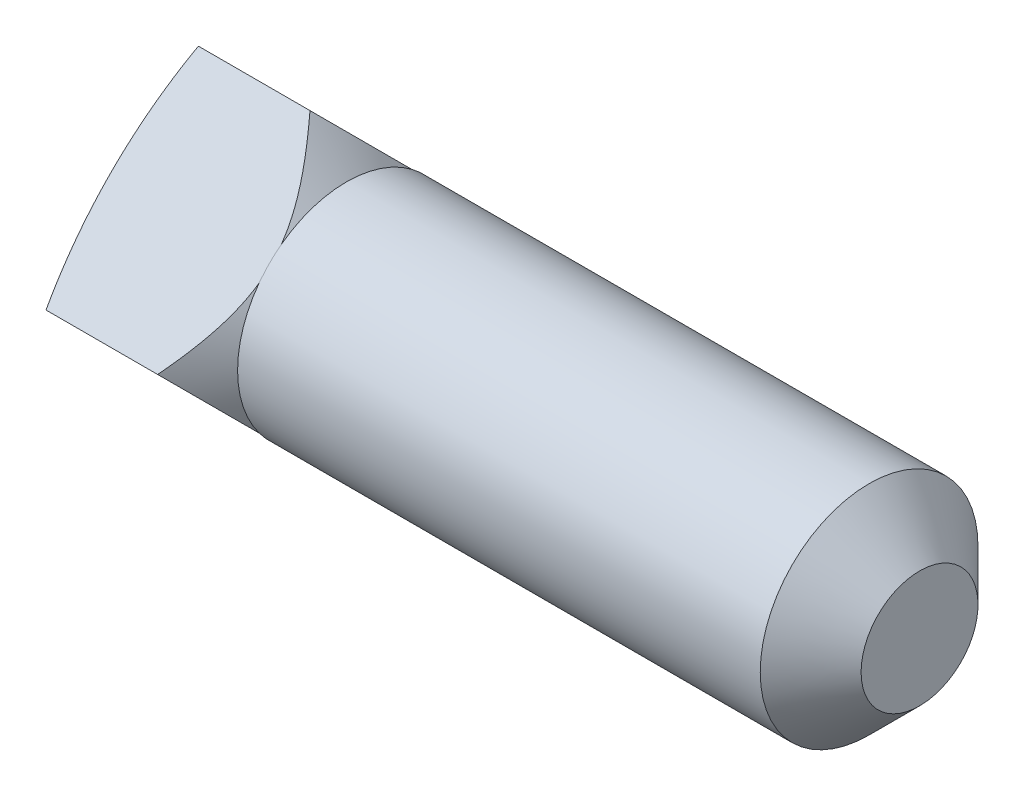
ISO-10303-21;
HEADER;
FILE_DESCRIPTION(('STEP AP214'),'2;1');
FILE_NAME('part.step','',(''),(''),'','','');
FILE_SCHEMA(('AUTOMOTIVE_DESIGN { 1 0 10303 214 1 1 1 1 }'));
ENDSEC;
DATA;
#1=APPLICATION_CONTEXT('core data for automotive mechanical design processes');
#2=APPLICATION_PROTOCOL_DEFINITION('international standard','automotive_design',2000,#1);
#3=PRODUCT_CONTEXT('',#1,'mechanical');
#4=PRODUCT('Part','Part','',(#3));
#5=PRODUCT_RELATED_PRODUCT_CATEGORY('part','',(#4));
#6=PRODUCT_DEFINITION_FORMATION('','',#4);
#7=PRODUCT_DEFINITION_CONTEXT('part definition',#1,'design');
#8=PRODUCT_DEFINITION('design','',#6,#7);
#9=PRODUCT_DEFINITION_SHAPE('','',#8);
#10=(LENGTH_UNIT() NAMED_UNIT(*) SI_UNIT(.MILLI.,.METRE.));
#11=(NAMED_UNIT(*) PLANE_ANGLE_UNIT() SI_UNIT($,.RADIAN.));
#12=(NAMED_UNIT(*) SI_UNIT($,.STERADIAN.) SOLID_ANGLE_UNIT());
#13=UNCERTAINTY_MEASURE_WITH_UNIT(LENGTH_MEASURE(1.E-05),#10,'distance_accuracy_value','');
#14=(GEOMETRIC_REPRESENTATION_CONTEXT(3) GLOBAL_UNCERTAINTY_ASSIGNED_CONTEXT((#13)) GLOBAL_UNIT_ASSIGNED_CONTEXT((#10,
#11,#12)) REPRESENTATION_CONTEXT('',''));
#15=CARTESIAN_POINT('',(0.,0.,0.));
#16=DIRECTION('',(0.,0.,1.));
#17=DIRECTION('',(1.,0.,0.));
#18=AXIS2_PLACEMENT_3D('',#15,#16,#17);
#19=CARTESIAN_POINT('',(-3.7592,0.,-3.376576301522));
#20=DIRECTION('',(0.,-0.707106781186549,0.707106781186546));
#21=DIRECTION('',(0.,-0.707106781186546,-0.707106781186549));
#22=AXIS2_PLACEMENT_3D('',#19,#20,#21);
#23=PLANE('',#22);
#24=CARTESIAN_POINT('',(-3.71463670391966,-2.84404188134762,-6.22061818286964));
#25=CARTESIAN_POINT('',(-3.55613835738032,-2.70146848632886,-6.07804478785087));
#26=CARTESIAN_POINT('',(-3.39814617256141,-2.55860959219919,-5.9351858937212));
#27=CARTESIAN_POINT('',(-3.08363247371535,-2.27203984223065,-5.64861614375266));
#28=CARTESIAN_POINT('',(-2.92711125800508,-2.12832882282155,-5.50490512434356));
#29=CARTESIAN_POINT('',(-2.61537743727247,-1.83919610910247,-5.21577241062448));
#30=CARTESIAN_POINT('',(-2.46017361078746,-1.6937696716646,-5.07034597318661));
#31=CARTESIAN_POINT('',(-2.15261018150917,-1.40143979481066,-4.77801609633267));
#32=CARTESIAN_POINT('',(-2.00025026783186,-1.25453651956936,-4.63111282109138));
#33=CARTESIAN_POINT('',(-1.72970912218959,-0.988182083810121,-4.36475838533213));
#34=CARTESIAN_POINT('',(-1.61078189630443,-0.86911118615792,-4.24568748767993));
#35=CARTESIAN_POINT('',(-1.37665028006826,-0.629105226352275,-4.00568152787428));
#36=CARTESIAN_POINT('',(-1.26144677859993,-0.508169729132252,-3.88474603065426));
#37=CARTESIAN_POINT('',(-1.03648369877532,-0.263755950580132,-3.64033225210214));
#38=CARTESIAN_POINT('',(-0.926724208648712,-0.140277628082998,-3.51685392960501));
#39=CARTESIAN_POINT('',(-0.768411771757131,0.0475823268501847,-3.32899397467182));
#40=CARTESIAN_POINT('',(-0.716703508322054,0.110632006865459,-3.26594429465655));
#41=CARTESIAN_POINT('',(-0.615958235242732,0.237786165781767,-3.13879013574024));
#42=CARTESIAN_POINT('',(-0.566920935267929,0.301890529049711,-3.0746857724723));
#43=CARTESIAN_POINT('',(-0.470564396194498,0.433616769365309,-2.9429595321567));
#44=CARTESIAN_POINT('',(-0.423365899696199,0.501283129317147,-2.87529317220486));
#45=CARTESIAN_POINT('',(-0.333664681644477,0.638144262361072,-2.73843203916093));
#46=CARTESIAN_POINT('',(-0.291160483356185,0.707338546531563,-2.66923775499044));
#47=CARTESIAN_POINT('',(-0.212295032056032,0.847303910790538,-2.52927239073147));
#48=CARTESIAN_POINT('',(-0.175920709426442,0.91807126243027,-2.45850503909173));
#49=CARTESIAN_POINT('',(-0.110910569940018,1.06137320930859,-2.31520309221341));
#50=CARTESIAN_POINT('',(-0.0822720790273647,1.13390718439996,-2.24266911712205));
#51=CARTESIAN_POINT('',(-0.0393755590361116,1.26582470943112,-2.11075159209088));
#52=CARTESIAN_POINT('',(-0.0233846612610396,1.32492428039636,-2.05165202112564));
#53=CARTESIAN_POINT('',(0.00161538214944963,1.44386018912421,-1.93271611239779));
#54=CARTESIAN_POINT('',(0.0106258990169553,1.50369637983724,-1.87287992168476));
#55=CARTESIAN_POINT('',(0.0210920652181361,1.62355655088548,-1.75301975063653));
#56=CARTESIAN_POINT('',(0.0225662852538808,1.68357970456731,-1.69299659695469));
#57=CARTESIAN_POINT('',(0.0179155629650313,1.80348109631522,-1.57309520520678));
#58=CARTESIAN_POINT('',(0.0117896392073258,1.86335931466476,-1.51321698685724));
#59=CARTESIAN_POINT('',(-0.010081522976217,1.99721927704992,-1.37935702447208));
#60=CARTESIAN_POINT('',(-0.027826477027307,2.07103738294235,-1.30553891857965));
#61=CARTESIAN_POINT('',(-0.0730208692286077,2.21718932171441,-1.15938697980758));
#62=CARTESIAN_POINT('',(-0.100477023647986,2.28952209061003,-1.08705421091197));
#63=CARTESIAN_POINT('',(-0.147658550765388,2.39694211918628,-0.979634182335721));
#64=CARTESIAN_POINT('',(-0.164455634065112,2.43269379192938,-0.943882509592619));
#65=CARTESIAN_POINT('',(-0.19981344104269,2.50374093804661,-0.872835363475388));
#66=CARTESIAN_POINT('',(-0.218373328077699,2.53903661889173,-0.837539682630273));
#67=CARTESIAN_POINT('',(-0.257053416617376,2.60919264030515,-0.767383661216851));
#68=CARTESIAN_POINT('',(-0.27717350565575,2.64405301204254,-0.732523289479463));
#69=CARTESIAN_POINT('',(-0.318791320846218,2.71336326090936,-0.663213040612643));
#70=CARTESIAN_POINT('',(-0.340289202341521,2.74781309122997,-0.628763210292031));
#71=CARTESIAN_POINT('',(-0.403215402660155,2.84534321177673,-0.531233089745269));
#72=CARTESIAN_POINT('',(-0.446099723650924,2.90795472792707,-0.468621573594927));
#73=CARTESIAN_POINT('',(-0.53512154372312,3.03201522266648,-0.344561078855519));
#74=CARTESIAN_POINT('',(-0.581259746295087,3.09346394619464,-0.283112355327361));
#75=CARTESIAN_POINT('',(-0.723571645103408,3.27639274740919,-0.100183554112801));
#76=CARTESIAN_POINT('',(-0.8235887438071,3.39637526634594,0.01979896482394));
#77=CARTESIAN_POINT('',(-1.03047356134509,3.63375592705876,0.25717962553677));
#78=CARTESIAN_POINT('',(-1.13735948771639,3.75114599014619,0.374569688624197));
#79=CARTESIAN_POINT('',(-1.35557896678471,3.98376603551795,0.607189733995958));
#80=CARTESIAN_POINT('',(-1.46691077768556,4.09899683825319,0.722420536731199));
#81=CARTESIAN_POINT('',(-1.6930561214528,4.328235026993,0.951658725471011));
#82=CARTESIAN_POINT('',(-1.80787896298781,4.44223779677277,1.06566149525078));
#83=CARTESIAN_POINT('',(-2.03983717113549,4.66907271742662,1.29249641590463));
#84=CARTESIAN_POINT('',(-2.15697273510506,4.78190476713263,1.40532846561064));
#85=CARTESIAN_POINT('',(-2.3927971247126,5.0065028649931,1.62992656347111));
#86=CARTESIAN_POINT('',(-2.51148349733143,5.11827020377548,1.74169390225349));
#87=CARTESIAN_POINT('',(-2.75017246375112,5.34109999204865,1.96452369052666));
#88=CARTESIAN_POINT('',(-2.87017506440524,5.45216243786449,2.0755861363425));
#89=CARTESIAN_POINT('',(-3.05068333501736,5.61808795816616,2.24151165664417));
#90=CARTESIAN_POINT('',(-3.11080136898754,5.67316227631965,2.29658597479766));
#91=CARTESIAN_POINT('',(-3.23127854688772,5.78319708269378,2.40662078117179));
#92=CARTESIAN_POINT('',(-3.29163773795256,5.83815754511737,2.46158124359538));
#93=CARTESIAN_POINT('',(-3.41233885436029,5.94776482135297,2.57118851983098));
#94=CARTESIAN_POINT('',(-3.47268003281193,6.00241204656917,2.62583574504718));
#95=CARTESIAN_POINT('',(-3.5935326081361,6.11159399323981,2.73501769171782));
#96=CARTESIAN_POINT('',(-3.65404396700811,6.16612873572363,2.78955243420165));
#97=CARTESIAN_POINT('',(-3.71463670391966,6.22061818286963,2.84404188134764));
#98=B_SPLINE_CURVE_WITH_KNOTS('',3,(#24,#25,#26,#27,#28,#29,#30,#31,#32,#33,#34,#35,#36,#37,#38,
#39,#40,#41,#42,#43,#44,#45,#46,#47,#48,#49,#50,#51,#52,#53,#54,#55,#56,#57,#58,#59,#60,#61,#62,
#63,#64,#65,#66,#67,#68,#69,#70,#71,#72,#73,#74,#75,#76,#77,#78,#79,#80,#81,#82,#83,#84,#85,#86,
#87,#88,#89,#90,#91,#92,#93,#94,#95,#96,#97),.UNSPECIFIED.,.F.,.F.,(4,2,2,2,2,2,2,2,2,2,2,2,2,2,
2,2,2,2,2,2,2,2,2,2,2,2,2,2,2,2,2,2,2,2,2,2,4),(0.,0.769411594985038,1.53897600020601,
2.31192373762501,3.08478647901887,3.70321119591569,4.32178246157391,4.94036374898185,
5.24955145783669,5.55870549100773,5.87871228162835,6.19861811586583,6.51783299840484,
6.83693739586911,7.0919662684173,7.3469450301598,7.60129517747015,7.85567817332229,
8.17279662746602,8.4901348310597,8.64994152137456,8.80967274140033,8.96939245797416,
9.1291302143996,9.42418817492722,9.71931012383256,10.3099299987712,10.9021857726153,
11.4942117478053,12.0879855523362,12.6818102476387,13.2747881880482,13.8677692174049,
14.1629380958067,14.4581678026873,14.7523159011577,15.0464028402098),.UNSPECIFIED.);
#99=CARTESIAN_POINT('',(-0.80853651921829,0.,-3.376576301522));
#100=VERTEX_POINT('',#99);
#101=CARTESIAN_POINT('',(0.,1.44137193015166,-1.93520437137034));
#102=VERTEX_POINT('',#101);
#103=EDGE_CURVE('E163',#100,#102,#98,.T.);
#104=ORIENTED_EDGE('',*,*,#103,.F.);
#105=DIRECTION('',(1.,0.,0.));
#106=VECTOR('',#105,1.);
#107=CARTESIAN_POINT('',(-3.7592,0.,-3.376576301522));
#108=LINE('',#107,#106);
#109=CARTESIAN_POINT('',(-3.2823012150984,0.,-3.376576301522));
#110=VERTEX_POINT('',#109);
#111=EDGE_CURVE('E144',#110,#100,#108,.T.);
#112=ORIENTED_EDGE('',*,*,#111,.F.);
#113=CARTESIAN_POINT('',(8.4328,1.688288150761,-1.688288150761));
#114=DIRECTION('',(0.,-0.707106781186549,0.707106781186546));
#115=DIRECTION('',(0.,-0.707106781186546,-0.707106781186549));
#116=AXIS2_PLACEMENT_3D('',#113,#114,#115);
#117=CIRCLE('',#116,11.9559286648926);
#118=CARTESIAN_POINT('',(-3.2823012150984,3.376576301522,0.));
#119=VERTEX_POINT('',#118);
#120=EDGE_CURVE('E153',#119,#110,#117,.T.);
#121=ORIENTED_EDGE('',*,*,#120,.F.);
#122=DIRECTION('',(1.,0.,0.));
#123=VECTOR('',#122,1.);
#124=CARTESIAN_POINT('',(-3.7592,3.376576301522,0.));
#125=LINE('',#124,#123);
#126=CARTESIAN_POINT('',(-0.80853651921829,3.376576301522,0.));
#127=VERTEX_POINT('',#126);
#128=EDGE_CURVE('E151',#119,#127,#125,.T.);
#129=ORIENTED_EDGE('',*,*,#128,.T.);
#130=CARTESIAN_POINT('',(0.,1.93520437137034,-1.44137193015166));
#131=VERTEX_POINT('',#130);
#132=EDGE_CURVE('E174',#131,#127,#98,.T.);
#133=ORIENTED_EDGE('',*,*,#132,.F.);
#134=DIRECTION('',(0.,-0.707106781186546,-0.707106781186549));
#135=VECTOR('',#134,1.);
#136=CARTESIAN_POINT('',(0.,0.,-3.376576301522));
#137=LINE('',#136,#135);
#138=EDGE_CURVE('E47',#131,#102,#137,.T.);
#139=ORIENTED_EDGE('',*,*,#138,.T.);
#140=EDGE_LOOP('',(#104,#112,#121,#129,#133,#139));
#141=FACE_BOUND('',#140,.T.);
#142=ADVANCED_FACE('F39',(#141),#23,.F.);
#143=CARTESIAN_POINT('',(-3.7592,0.,-3.376576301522));
#144=DIRECTION('',(0.,0.707106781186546,0.707106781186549));
#145=DIRECTION('',(0.,-0.707106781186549,0.707106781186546));
#146=AXIS2_PLACEMENT_3D('',#143,#144,#145);
#147=PLANE('',#146);
#148=CARTESIAN_POINT('',(-3.71463670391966,-6.22061818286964,2.84404188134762));
#149=CARTESIAN_POINT('',(-3.55613835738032,-6.07804478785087,2.70146848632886));
#150=CARTESIAN_POINT('',(-3.39814617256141,-5.9351858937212,2.55860959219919));
#151=CARTESIAN_POINT('',(-3.08363247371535,-5.64861614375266,2.27203984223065));
#152=CARTESIAN_POINT('',(-2.92711125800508,-5.50490512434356,2.12832882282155));
#153=CARTESIAN_POINT('',(-2.61537743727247,-5.21577241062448,1.83919610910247));
#154=CARTESIAN_POINT('',(-2.46017361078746,-5.07034597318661,1.6937696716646));
#155=CARTESIAN_POINT('',(-2.15261018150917,-4.77801609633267,1.40143979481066));
#156=CARTESIAN_POINT('',(-2.00025026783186,-4.63111282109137,1.25453651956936));
#157=CARTESIAN_POINT('',(-1.72970912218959,-4.36475838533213,0.988182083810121));
#158=CARTESIAN_POINT('',(-1.61078189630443,-4.24568748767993,0.86911118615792));
#159=CARTESIAN_POINT('',(-1.37665028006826,-4.00568152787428,0.629105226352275));
#160=CARTESIAN_POINT('',(-1.26144677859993,-3.88474603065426,0.508169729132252));
#161=CARTESIAN_POINT('',(-1.03648369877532,-3.64033225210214,0.263755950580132));
#162=CARTESIAN_POINT('',(-0.926724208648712,-3.51685392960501,0.140277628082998));
#163=CARTESIAN_POINT('',(-0.76841177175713,-3.32899397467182,-0.0475823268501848));
#164=CARTESIAN_POINT('',(-0.716703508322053,-3.26594429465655,-0.11063200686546));
#165=CARTESIAN_POINT('',(-0.615958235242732,-3.13879013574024,-0.237786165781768));
#166=CARTESIAN_POINT('',(-0.566920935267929,-3.0746857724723,-0.301890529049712));
#167=CARTESIAN_POINT('',(-0.470564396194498,-2.9429595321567,-0.433616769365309));
#168=CARTESIAN_POINT('',(-0.423365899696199,-2.87529317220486,-0.501283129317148));
#169=CARTESIAN_POINT('',(-0.333664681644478,-2.73843203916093,-0.638144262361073));
#170=CARTESIAN_POINT('',(-0.291160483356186,-2.66923775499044,-0.707338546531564));
#171=CARTESIAN_POINT('',(-0.212295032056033,-2.52927239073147,-0.847303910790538));
#172=CARTESIAN_POINT('',(-0.175920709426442,-2.45850503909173,-0.91807126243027));
#173=CARTESIAN_POINT('',(-0.110910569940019,-2.31520309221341,-1.06137320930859));
#174=CARTESIAN_POINT('',(-0.0822720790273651,-2.24266911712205,-1.13390718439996));
#175=CARTESIAN_POINT('',(-0.0393755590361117,-2.11075159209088,-1.26582470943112));
#176=CARTESIAN_POINT('',(-0.0233846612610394,-2.05165202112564,-1.32492428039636));
#177=CARTESIAN_POINT('',(0.00161538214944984,-1.93271611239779,-1.44386018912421));
#178=CARTESIAN_POINT('',(0.0106258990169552,-1.87287992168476,-1.50369637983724));
#179=CARTESIAN_POINT('',(0.0210920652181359,-1.75301975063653,-1.62355655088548));
#180=CARTESIAN_POINT('',(0.0225662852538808,-1.69299659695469,-1.68357970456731));
#181=CARTESIAN_POINT('',(0.0179155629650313,-1.57309520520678,-1.80348109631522));
#182=CARTESIAN_POINT('',(0.0117896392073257,-1.51321698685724,-1.86335931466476));
#183=CARTESIAN_POINT('',(-0.0100815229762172,-1.37935702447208,-1.99721927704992));
#184=CARTESIAN_POINT('',(-0.0278264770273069,-1.30553891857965,-2.07103738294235));
#185=CARTESIAN_POINT('',(-0.0730208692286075,-1.15938697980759,-2.21718932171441));
#186=CARTESIAN_POINT('',(-0.100477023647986,-1.08705421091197,-2.28952209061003));
#187=CARTESIAN_POINT('',(-0.147658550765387,-0.979634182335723,-2.39694211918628));
#188=CARTESIAN_POINT('',(-0.164455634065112,-0.94388250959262,-2.43269379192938));
#189=CARTESIAN_POINT('',(-0.19981344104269,-0.87283536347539,-2.50374093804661));
#190=CARTESIAN_POINT('',(-0.218373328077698,-0.837539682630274,-2.53903661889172));
#191=CARTESIAN_POINT('',(-0.257053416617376,-0.767383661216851,-2.60919264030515));
#192=CARTESIAN_POINT('',(-0.27717350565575,-0.732523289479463,-2.64405301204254));
#193=CARTESIAN_POINT('',(-0.318791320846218,-0.663213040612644,-2.71336326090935));
#194=CARTESIAN_POINT('',(-0.340289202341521,-0.628763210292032,-2.74781309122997));
#195=CARTESIAN_POINT('',(-0.403215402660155,-0.53123308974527,-2.84534321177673));
#196=CARTESIAN_POINT('',(-0.446099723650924,-0.468621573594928,-2.90795472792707));
#197=CARTESIAN_POINT('',(-0.535121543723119,-0.34456107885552,-3.03201522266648));
#198=CARTESIAN_POINT('',(-0.581259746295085,-0.283112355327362,-3.09346394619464));
#199=CARTESIAN_POINT('',(-0.723571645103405,-0.100183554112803,-3.27639274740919));
#200=CARTESIAN_POINT('',(-0.823588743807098,0.0197989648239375,-3.39637526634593));
#201=CARTESIAN_POINT('',(-1.03047356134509,0.257179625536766,-3.63375592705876));
#202=CARTESIAN_POINT('',(-1.13735948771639,0.374569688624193,-3.75114599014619));
#203=CARTESIAN_POINT('',(-1.35557896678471,0.607189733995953,-3.98376603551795));
#204=CARTESIAN_POINT('',(-1.46691077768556,0.722420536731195,-4.09899683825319));
#205=CARTESIAN_POINT('',(-1.69305612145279,0.951658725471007,-4.328235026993));
#206=CARTESIAN_POINT('',(-1.80787896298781,1.06566149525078,-4.44223779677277));
#207=CARTESIAN_POINT('',(-2.03983717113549,1.29249641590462,-4.66907271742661));
#208=CARTESIAN_POINT('',(-2.15697273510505,1.40532846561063,-4.78190476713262));
#209=CARTESIAN_POINT('',(-2.3927971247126,1.62992656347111,-5.0065028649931));
#210=CARTESIAN_POINT('',(-2.51148349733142,1.74169390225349,-5.11827020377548));
#211=CARTESIAN_POINT('',(-2.75017246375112,1.96452369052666,-5.34109999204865));
#212=CARTESIAN_POINT('',(-2.87017506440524,2.07558613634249,-5.45216243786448));
#213=CARTESIAN_POINT('',(-3.05068333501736,2.24151165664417,-5.61808795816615));
#214=CARTESIAN_POINT('',(-3.11080136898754,2.29658597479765,-5.67316227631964));
#215=CARTESIAN_POINT('',(-3.23127854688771,2.40662078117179,-5.78319708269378));
#216=CARTESIAN_POINT('',(-3.29163773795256,2.46158124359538,-5.83815754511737));
#217=CARTESIAN_POINT('',(-3.41233885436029,2.57118851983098,-5.94776482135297));
#218=CARTESIAN_POINT('',(-3.47268003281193,2.62583574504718,-6.00241204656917));
#219=CARTESIAN_POINT('',(-3.59353260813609,2.73501769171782,-6.11159399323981));
#220=CARTESIAN_POINT('',(-3.65404396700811,2.78955243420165,-6.16612873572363));
#221=CARTESIAN_POINT('',(-3.71463670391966,2.84404188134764,-6.22061818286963));
#222=B_SPLINE_CURVE_WITH_KNOTS('',3,(#148,#149,#150,#151,#152,#153,#154,#155,#156,#157,#158,
#159,#160,#161,#162,#163,#164,#165,#166,#167,#168,#169,#170,#171,#172,#173,#174,#175,#176,#177,
#178,#179,#180,#181,#182,#183,#184,#185,#186,#187,#188,#189,#190,#191,#192,#193,#194,#195,#196,
#197,#198,#199,#200,#201,#202,#203,#204,#205,#206,#207,#208,#209,#210,#211,#212,#213,#214,#215,
#216,#217,#218,#219,#220,#221),.UNSPECIFIED.,.F.,.F.,(4,2,2,2,2,2,2,2,2,2,2,2,2,2,2,2,2,2,2,2,2,
2,2,2,2,2,2,2,2,2,2,2,2,2,2,2,4),(0.,0.769411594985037,1.53897600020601,2.31192373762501,
3.08478647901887,3.70321119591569,4.32178246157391,4.94036374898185,5.24955145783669,
5.55870549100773,5.87871228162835,6.19861811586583,6.51783299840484,6.83693739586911,
7.0919662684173,7.3469450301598,7.60129517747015,7.85567817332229,8.17279662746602,
8.4901348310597,8.64994152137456,8.80967274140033,8.96939245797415,9.1291302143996,
9.42418817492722,9.71931012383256,10.3099299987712,10.9021857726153,11.4942117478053,
12.0879855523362,12.6818102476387,13.2747881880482,13.8677692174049,14.1629380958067,
14.4581678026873,14.7523159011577,15.0464028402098),.UNSPECIFIED.);
#223=CARTESIAN_POINT('',(-0.80853651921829,-3.376576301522,0.));
#224=VERTEX_POINT('',#223);
#225=CARTESIAN_POINT('',(0.,-1.93520437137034,-1.44137193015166));
#226=VERTEX_POINT('',#225);
#227=EDGE_CURVE('E164',#224,#226,#222,.T.);
#228=ORIENTED_EDGE('',*,*,#227,.F.);
#229=DIRECTION('',(1.,0.,0.));
#230=VECTOR('',#229,1.);
#231=CARTESIAN_POINT('',(-3.7592,-3.376576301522,0.));
#232=LINE('',#231,#230);
#233=CARTESIAN_POINT('',(-3.2823012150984,-3.376576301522,0.));
#234=VERTEX_POINT('',#233);
#235=EDGE_CURVE('E147',#234,#224,#232,.T.);
#236=ORIENTED_EDGE('',*,*,#235,.F.);
#237=CARTESIAN_POINT('',(8.4328,-1.688288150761,-1.688288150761));
#238=DIRECTION('',(0.,0.707106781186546,0.707106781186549));
#239=DIRECTION('',(0.,-0.707106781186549,0.707106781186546));
#240=AXIS2_PLACEMENT_3D('',#237,#238,#239);
#241=CIRCLE('',#240,11.9559286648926);
#242=EDGE_CURVE('E160',#110,#234,#241,.T.);
#243=ORIENTED_EDGE('',*,*,#242,.F.);
#244=ORIENTED_EDGE('',*,*,#111,.T.);
#245=CARTESIAN_POINT('',(0.,-1.44137193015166,-1.93520437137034));
#246=VERTEX_POINT('',#245);
#247=EDGE_CURVE('E172',#246,#100,#222,.T.);
#248=ORIENTED_EDGE('',*,*,#247,.F.);
#249=DIRECTION('',(0.,-0.707106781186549,0.707106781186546));
#250=VECTOR('',#249,1.);
#251=CARTESIAN_POINT('',(0.,0.,-3.376576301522));
#252=LINE('',#251,#250);
#253=EDGE_CURVE('E134',#246,#226,#252,.T.);
#254=ORIENTED_EDGE('',*,*,#253,.T.);
#255=EDGE_LOOP('',(#228,#236,#243,#244,#248,#254));
#256=FACE_BOUND('',#255,.T.);
#257=ADVANCED_FACE('F181',(#256),#147,.F.);
#258=CARTESIAN_POINT('',(-3.7592,-3.376576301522,0.));
#259=DIRECTION('',(0.,0.707106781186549,-0.707106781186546));
#260=DIRECTION('',(0.,0.707106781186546,0.707106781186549));
#261=AXIS2_PLACEMENT_3D('',#258,#259,#260);
#262=PLANE('',#261);
#263=CARTESIAN_POINT('',(-3.71463670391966,2.84404188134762,6.22061818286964));
#264=CARTESIAN_POINT('',(-3.55613835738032,2.70146848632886,6.07804478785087));
#265=CARTESIAN_POINT('',(-3.39814617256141,2.55860959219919,5.9351858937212));
#266=CARTESIAN_POINT('',(-3.08363247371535,2.27203984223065,5.64861614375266));
#267=CARTESIAN_POINT('',(-2.92711125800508,2.12832882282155,5.50490512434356));
#268=CARTESIAN_POINT('',(-2.61537743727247,1.83919610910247,5.21577241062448));
#269=CARTESIAN_POINT('',(-2.46017361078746,1.6937696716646,5.07034597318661));
#270=CARTESIAN_POINT('',(-2.15261018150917,1.40143979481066,4.77801609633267));
#271=CARTESIAN_POINT('',(-2.00025026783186,1.25453651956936,4.63111282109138));
#272=CARTESIAN_POINT('',(-1.72970912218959,0.988182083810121,4.36475838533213));
#273=CARTESIAN_POINT('',(-1.61078189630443,0.86911118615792,4.24568748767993));
#274=CARTESIAN_POINT('',(-1.37665028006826,0.629105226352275,4.00568152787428));
#275=CARTESIAN_POINT('',(-1.26144677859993,0.508169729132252,3.88474603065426));
#276=CARTESIAN_POINT('',(-1.03648369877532,0.263755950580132,3.64033225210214));
#277=CARTESIAN_POINT('',(-0.926724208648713,0.140277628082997,3.51685392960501));
#278=CARTESIAN_POINT('',(-0.768411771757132,-0.0475823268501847,3.32899397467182));
#279=CARTESIAN_POINT('',(-0.716703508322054,-0.110632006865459,3.26594429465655));
#280=CARTESIAN_POINT('',(-0.615958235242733,-0.237786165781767,3.13879013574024));
#281=CARTESIAN_POINT('',(-0.56692093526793,-0.301890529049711,3.0746857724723));
#282=CARTESIAN_POINT('',(-0.470564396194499,-0.433616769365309,2.9429595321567));
#283=CARTESIAN_POINT('',(-0.4233658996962,-0.501283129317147,2.87529317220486));
#284=CARTESIAN_POINT('',(-0.333664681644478,-0.638144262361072,2.73843203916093));
#285=CARTESIAN_POINT('',(-0.291160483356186,-0.707338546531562,2.66923775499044));
#286=CARTESIAN_POINT('',(-0.212295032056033,-0.847303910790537,2.52927239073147));
#287=CARTESIAN_POINT('',(-0.175920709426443,-0.918071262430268,2.45850503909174));
#288=CARTESIAN_POINT('',(-0.110910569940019,-1.06137320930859,2.31520309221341));
#289=CARTESIAN_POINT('',(-0.0822720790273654,-1.13390718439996,2.24266911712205));
#290=CARTESIAN_POINT('',(-0.039375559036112,-1.26582470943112,2.11075159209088));
#291=CARTESIAN_POINT('',(-0.0233846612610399,-1.32492428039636,2.05165202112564));
#292=CARTESIAN_POINT('',(0.00161538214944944,-1.44386018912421,1.93271611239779));
#293=CARTESIAN_POINT('',(0.0106258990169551,-1.50369637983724,1.87287992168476));
#294=CARTESIAN_POINT('',(0.021092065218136,-1.62355655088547,1.75301975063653));
#295=CARTESIAN_POINT('',(0.0225662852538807,-1.68357970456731,1.69299659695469));
#296=CARTESIAN_POINT('',(0.0179155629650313,-1.80348109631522,1.57309520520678));
#297=CARTESIAN_POINT('',(0.0117896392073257,-1.86335931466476,1.51321698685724));
#298=CARTESIAN_POINT('',(-0.010081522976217,-1.99721927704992,1.37935702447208));
#299=CARTESIAN_POINT('',(-0.0278264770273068,-2.07103738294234,1.30553891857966));
#300=CARTESIAN_POINT('',(-0.0730208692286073,-2.21718932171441,1.15938697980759));
#301=CARTESIAN_POINT('',(-0.100477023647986,-2.28952209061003,1.08705421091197));
#302=CARTESIAN_POINT('',(-0.147658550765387,-2.39694211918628,0.979634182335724));
#303=CARTESIAN_POINT('',(-0.164455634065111,-2.43269379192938,0.943882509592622));
#304=CARTESIAN_POINT('',(-0.199813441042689,-2.50374093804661,0.872835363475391));
#305=CARTESIAN_POINT('',(-0.218373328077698,-2.53903661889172,0.837539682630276));
#306=CARTESIAN_POINT('',(-0.257053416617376,-2.60919264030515,0.767383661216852));
#307=CARTESIAN_POINT('',(-0.27717350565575,-2.64405301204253,0.732523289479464));
#308=CARTESIAN_POINT('',(-0.318791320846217,-2.71336326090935,0.663213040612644));
#309=CARTESIAN_POINT('',(-0.340289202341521,-2.74781309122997,0.628763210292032));
#310=CARTESIAN_POINT('',(-0.403215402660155,-2.84534321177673,0.53123308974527));
#311=CARTESIAN_POINT('',(-0.446099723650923,-2.90795472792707,0.468621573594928));
#312=CARTESIAN_POINT('',(-0.535121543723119,-3.03201522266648,0.344561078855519));
#313=CARTESIAN_POINT('',(-0.581259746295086,-3.09346394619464,0.283112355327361));
#314=CARTESIAN_POINT('',(-0.723571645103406,-3.27639274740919,0.100183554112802));
#315=CARTESIAN_POINT('',(-0.823588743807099,-3.39637526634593,-0.0197989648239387));
#316=CARTESIAN_POINT('',(-1.03047356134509,-3.63375592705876,-0.257179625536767));
#317=CARTESIAN_POINT('',(-1.13735948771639,-3.75114599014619,-0.374569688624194));
#318=CARTESIAN_POINT('',(-1.35557896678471,-3.98376603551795,-0.607189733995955));
#319=CARTESIAN_POINT('',(-1.46691077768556,-4.09899683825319,-0.722420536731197));
#320=CARTESIAN_POINT('',(-1.6930561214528,-4.328235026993,-0.951658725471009));
#321=CARTESIAN_POINT('',(-1.80787896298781,-4.44223779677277,-1.06566149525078));
#322=CARTESIAN_POINT('',(-2.03983717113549,-4.66907271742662,-1.29249641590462));
#323=CARTESIAN_POINT('',(-2.15697273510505,-4.78190476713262,-1.40532846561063));
#324=CARTESIAN_POINT('',(-2.3927971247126,-5.0065028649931,-1.62992656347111));
#325=CARTESIAN_POINT('',(-2.51148349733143,-5.11827020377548,-1.74169390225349));
#326=CARTESIAN_POINT('',(-2.75017246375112,-5.34109999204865,-1.96452369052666));
#327=CARTESIAN_POINT('',(-2.87017506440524,-5.45216243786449,-2.0755861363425));
#328=CARTESIAN_POINT('',(-3.05068333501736,-5.61808795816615,-2.24151165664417));
#329=CARTESIAN_POINT('',(-3.11080136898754,-5.67316227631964,-2.29658597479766));
#330=CARTESIAN_POINT('',(-3.23127854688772,-5.78319708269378,-2.40662078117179));
#331=CARTESIAN_POINT('',(-3.29163773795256,-5.83815754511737,-2.46158124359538));
#332=CARTESIAN_POINT('',(-3.41233885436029,-5.94776482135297,-2.57118851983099));
#333=CARTESIAN_POINT('',(-3.47268003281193,-6.00241204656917,-2.62583574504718));
#334=CARTESIAN_POINT('',(-3.5935326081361,-6.11159399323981,-2.73501769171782));
#335=CARTESIAN_POINT('',(-3.65404396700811,-6.16612873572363,-2.78955243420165));
#336=CARTESIAN_POINT('',(-3.71463670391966,-6.22061818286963,-2.84404188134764));
#337=B_SPLINE_CURVE_WITH_KNOTS('',3,(#263,#264,#265,#266,#267,#268,#269,#270,#271,#272,#273,
#274,#275,#276,#277,#278,#279,#280,#281,#282,#283,#284,#285,#286,#287,#288,#289,#290,#291,#292,
#293,#294,#295,#296,#297,#298,#299,#300,#301,#302,#303,#304,#305,#306,#307,#308,#309,#310,#311,
#312,#313,#314,#315,#316,#317,#318,#319,#320,#321,#322,#323,#324,#325,#326,#327,#328,#329,#330,
#331,#332,#333,#334,#335,#336),.UNSPECIFIED.,.F.,.F.,(4,2,2,2,2,2,2,2,2,2,2,2,2,2,2,2,2,2,2,2,2,
2,2,2,2,2,2,2,2,2,2,2,2,2,2,2,4),(0.,0.769411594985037,1.53897600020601,2.31192373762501,
3.08478647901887,3.70321119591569,4.32178246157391,4.94036374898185,5.24955145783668,
5.55870549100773,5.87871228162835,6.19861811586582,6.51783299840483,6.83693739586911,
7.0919662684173,7.3469450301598,7.60129517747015,7.85567817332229,8.17279662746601,
8.4901348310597,8.64994152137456,8.80967274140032,8.96939245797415,9.12913021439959,
9.42418817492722,9.71931012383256,10.3099299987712,10.9021857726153,11.4942117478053,
12.0879855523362,12.6818102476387,13.2747881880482,13.8677692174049,14.1629380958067,
14.4581678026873,14.7523159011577,15.0464028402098),.UNSPECIFIED.);
#338=CARTESIAN_POINT('',(-0.80853651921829,0.,3.376576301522));
#339=VERTEX_POINT('',#338);
#340=CARTESIAN_POINT('',(0.,-1.44137193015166,1.93520437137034));
#341=VERTEX_POINT('',#340);
#342=EDGE_CURVE('E61',#339,#341,#337,.T.);
#343=ORIENTED_EDGE('',*,*,#342,.F.);
#344=DIRECTION('',(1.,0.,0.));
#345=VECTOR('',#344,1.);
#346=CARTESIAN_POINT('',(-3.7592,0.,3.376576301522));
#347=LINE('',#346,#345);
#348=CARTESIAN_POINT('',(-3.2823012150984,0.,3.376576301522));
#349=VERTEX_POINT('',#348);
#350=EDGE_CURVE('E122',#349,#339,#347,.T.);
#351=ORIENTED_EDGE('',*,*,#350,.F.);
#352=CARTESIAN_POINT('',(8.4328,-1.688288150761,1.688288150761));
#353=DIRECTION('',(0.,0.707106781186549,-0.707106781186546));
#354=DIRECTION('',(0.,0.707106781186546,0.707106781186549));
#355=AXIS2_PLACEMENT_3D('',#352,#353,#354);
#356=CIRCLE('',#355,11.9559286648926);
#357=EDGE_CURVE('E53',#234,#349,#356,.T.);
#358=ORIENTED_EDGE('',*,*,#357,.F.);
#359=ORIENTED_EDGE('',*,*,#235,.T.);
#360=CARTESIAN_POINT('',(0.,-1.93520437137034,1.44137193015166));
#361=VERTEX_POINT('',#360);
#362=EDGE_CURVE('E173',#361,#224,#337,.T.);
#363=ORIENTED_EDGE('',*,*,#362,.F.);
#364=DIRECTION('',(0.,0.707106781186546,0.707106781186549));
#365=VECTOR('',#364,1.);
#366=CARTESIAN_POINT('',(0.,-3.376576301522,0.));
#367=LINE('',#366,#365);
#368=EDGE_CURVE('E128',#361,#341,#367,.T.);
#369=ORIENTED_EDGE('',*,*,#368,.T.);
#370=EDGE_LOOP('',(#343,#351,#358,#359,#363,#369));
#371=FACE_BOUND('',#370,.T.);
#372=ADVANCED_FACE('F204',(#371),#262,.F.);
#373=CARTESIAN_POINT('',(-3.7592,3.376576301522,0.));
#374=DIRECTION('',(0.,-0.707106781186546,-0.707106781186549));
#375=DIRECTION('',(0.,0.707106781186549,-0.707106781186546));
#376=AXIS2_PLACEMENT_3D('',#373,#374,#375);
#377=PLANE('',#376);
#378=CARTESIAN_POINT('',(-3.71463670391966,6.22061818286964,-2.84404188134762));
#379=CARTESIAN_POINT('',(-3.55613835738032,6.07804478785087,-2.70146848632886));
#380=CARTESIAN_POINT('',(-3.39814617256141,5.9351858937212,-2.55860959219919));
#381=CARTESIAN_POINT('',(-3.08363247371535,5.64861614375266,-2.27203984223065));
#382=CARTESIAN_POINT('',(-2.92711125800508,5.50490512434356,-2.12832882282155));
#383=CARTESIAN_POINT('',(-2.61537743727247,5.21577241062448,-1.83919610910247));
#384=CARTESIAN_POINT('',(-2.46017361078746,5.07034597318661,-1.6937696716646));
#385=CARTESIAN_POINT('',(-2.15261018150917,4.77801609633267,-1.40143979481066));
#386=CARTESIAN_POINT('',(-2.00025026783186,4.63111282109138,-1.25453651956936));
#387=CARTESIAN_POINT('',(-1.72970912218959,4.36475838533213,-0.988182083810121));
#388=CARTESIAN_POINT('',(-1.61078189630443,4.24568748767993,-0.86911118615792));
#389=CARTESIAN_POINT('',(-1.37665028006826,4.00568152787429,-0.629105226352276));
#390=CARTESIAN_POINT('',(-1.26144677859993,3.88474603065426,-0.508169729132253));
#391=CARTESIAN_POINT('',(-1.03648369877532,3.64033225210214,-0.263755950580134));
#392=CARTESIAN_POINT('',(-0.926724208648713,3.51685392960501,-0.140277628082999));
#393=CARTESIAN_POINT('',(-0.768411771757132,3.32899397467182,0.0475823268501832));
#394=CARTESIAN_POINT('',(-0.716703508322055,3.26594429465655,0.110632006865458));
#395=CARTESIAN_POINT('',(-0.615958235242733,3.13879013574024,0.237786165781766));
#396=CARTESIAN_POINT('',(-0.56692093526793,3.0746857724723,0.301890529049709));
#397=CARTESIAN_POINT('',(-0.470564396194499,2.9429595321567,0.433616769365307));
#398=CARTESIAN_POINT('',(-0.4233658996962,2.87529317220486,0.501283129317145));
#399=CARTESIAN_POINT('',(-0.333664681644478,2.73843203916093,0.638144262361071));
#400=CARTESIAN_POINT('',(-0.291160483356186,2.66923775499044,0.707338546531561));
#401=CARTESIAN_POINT('',(-0.212295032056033,2.52927239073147,0.847303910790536));
#402=CARTESIAN_POINT('',(-0.175920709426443,2.45850503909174,0.918071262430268));
#403=CARTESIAN_POINT('',(-0.110910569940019,2.31520309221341,1.06137320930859));
#404=CARTESIAN_POINT('',(-0.0822720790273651,2.24266911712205,1.13390718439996));
#405=CARTESIAN_POINT('',(-0.0393755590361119,2.11075159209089,1.26582470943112));
#406=CARTESIAN_POINT('',(-0.0233846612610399,2.05165202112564,1.32492428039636));
#407=CARTESIAN_POINT('',(0.00161538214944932,1.93271611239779,1.44386018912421));
#408=CARTESIAN_POINT('',(0.010625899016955,1.87287992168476,1.50369637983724));
#409=CARTESIAN_POINT('',(0.0210920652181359,1.75301975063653,1.62355655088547));
#410=CARTESIAN_POINT('',(0.0225662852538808,1.69299659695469,1.68357970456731));
#411=CARTESIAN_POINT('',(0.0179155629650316,1.57309520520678,1.80348109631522));
#412=CARTESIAN_POINT('',(0.0117896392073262,1.51321698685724,1.86335931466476));
#413=CARTESIAN_POINT('',(-0.0100815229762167,1.37935702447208,1.99721927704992));
#414=CARTESIAN_POINT('',(-0.0278264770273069,1.30553891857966,2.07103738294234));
#415=CARTESIAN_POINT('',(-0.0730208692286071,1.15938697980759,2.21718932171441));
#416=CARTESIAN_POINT('',(-0.100477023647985,1.08705421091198,2.28952209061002));
#417=CARTESIAN_POINT('',(-0.147658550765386,0.979634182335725,2.39694211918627));
#418=CARTESIAN_POINT('',(-0.16445563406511,0.943882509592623,2.43269379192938));
#419=CARTESIAN_POINT('',(-0.199813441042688,0.872835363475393,2.50374093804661));
#420=CARTESIAN_POINT('',(-0.218373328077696,0.837539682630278,2.53903661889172));
#421=CARTESIAN_POINT('',(-0.257053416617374,0.767383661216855,2.60919264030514));
#422=CARTESIAN_POINT('',(-0.277173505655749,0.732523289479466,2.64405301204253));
#423=CARTESIAN_POINT('',(-0.318791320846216,0.663213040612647,2.71336326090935));
#424=CARTESIAN_POINT('',(-0.340289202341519,0.628763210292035,2.74781309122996));
#425=CARTESIAN_POINT('',(-0.403215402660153,0.531233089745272,2.84534321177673));
#426=CARTESIAN_POINT('',(-0.446099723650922,0.46862157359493,2.90795472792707));
#427=CARTESIAN_POINT('',(-0.535121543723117,0.344561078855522,3.03201522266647));
#428=CARTESIAN_POINT('',(-0.581259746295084,0.283112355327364,3.09346394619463));
#429=CARTESIAN_POINT('',(-0.723571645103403,0.100183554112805,3.27639274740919));
#430=CARTESIAN_POINT('',(-0.823588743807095,-0.0197989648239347,3.39637526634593));
#431=CARTESIAN_POINT('',(-1.03047356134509,-0.257179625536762,3.63375592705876));
#432=CARTESIAN_POINT('',(-1.13735948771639,-0.374569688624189,3.75114599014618));
#433=CARTESIAN_POINT('',(-1.3555789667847,-0.607189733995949,3.98376603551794));
#434=CARTESIAN_POINT('',(-1.46691077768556,-0.722420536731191,4.09899683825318));
#435=CARTESIAN_POINT('',(-1.69305612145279,-0.951658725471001,4.32823502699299));
#436=CARTESIAN_POINT('',(-1.8078789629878,-1.06566149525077,4.44223779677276));
#437=CARTESIAN_POINT('',(-2.03983717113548,-1.29249641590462,4.66907271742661));
#438=CARTESIAN_POINT('',(-2.15697273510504,-1.40532846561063,4.78190476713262));
#439=CARTESIAN_POINT('',(-2.39279712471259,-1.6299265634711,5.00650286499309));
#440=CARTESIAN_POINT('',(-2.51148349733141,-1.74169390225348,5.11827020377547));
#441=CARTESIAN_POINT('',(-2.7501724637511,-1.96452369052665,5.34109999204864));
#442=CARTESIAN_POINT('',(-2.87017506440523,-2.07558613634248,5.45216243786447));
#443=CARTESIAN_POINT('',(-3.05068333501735,-2.24151165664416,5.61808795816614));
#444=CARTESIAN_POINT('',(-3.11080136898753,-2.29658597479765,5.67316227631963));
#445=CARTESIAN_POINT('',(-3.23127854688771,-2.40662078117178,5.78319708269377));
#446=CARTESIAN_POINT('',(-3.29163773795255,-2.46158124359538,5.83815754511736));
#447=CARTESIAN_POINT('',(-3.41233885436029,-2.57118851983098,5.94776482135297));
#448=CARTESIAN_POINT('',(-3.47268003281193,-2.62583574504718,6.00241204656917));
#449=CARTESIAN_POINT('',(-3.59353260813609,-2.73501769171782,6.11159399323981));
#450=CARTESIAN_POINT('',(-3.65404396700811,-2.78955243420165,6.16612873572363));
#451=CARTESIAN_POINT('',(-3.71463670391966,-2.84404188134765,6.22061818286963));
#452=B_SPLINE_CURVE_WITH_KNOTS('',3,(#378,#379,#380,#381,#382,#383,#384,#385,#386,#387,#388,
#389,#390,#391,#392,#393,#394,#395,#396,#397,#398,#399,#400,#401,#402,#403,#404,#405,#406,#407,
#408,#409,#410,#411,#412,#413,#414,#415,#416,#417,#418,#419,#420,#421,#422,#423,#424,#425,#426,
#427,#428,#429,#430,#431,#432,#433,#434,#435,#436,#437,#438,#439,#440,#441,#442,#443,#444,#445,
#446,#447,#448,#449,#450,#451),.UNSPECIFIED.,.F.,.F.,(4,2,2,2,2,2,2,2,2,2,2,2,2,2,2,2,2,2,2,2,2,
2,2,2,2,2,2,2,2,2,2,2,2,2,2,2,4),(0.,0.769411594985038,1.53897600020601,2.31192373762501,
3.08478647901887,3.70321119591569,4.32178246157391,4.94036374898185,5.24955145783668,
5.55870549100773,5.87871228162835,6.19861811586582,6.51783299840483,6.83693739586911,
7.0919662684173,7.3469450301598,7.60129517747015,7.85567817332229,8.17279662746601,
8.4901348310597,8.64994152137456,8.80967274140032,8.96939245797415,9.12913021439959,
9.42418817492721,9.71931012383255,10.3099299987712,10.9021857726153,11.4942117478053,
12.0879855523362,12.6818102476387,13.2747881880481,13.8677692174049,14.1629380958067,
14.4581678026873,14.7523159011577,15.0464028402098),.UNSPECIFIED.);
#453=CARTESIAN_POINT('',(0.,1.93520437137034,1.44137193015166));
#454=VERTEX_POINT('',#453);
#455=EDGE_CURVE('E124',#127,#454,#452,.T.);
#456=ORIENTED_EDGE('',*,*,#455,.F.);
#457=ORIENTED_EDGE('',*,*,#128,.F.);
#458=CARTESIAN_POINT('',(8.4328,1.688288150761,1.688288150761));
#459=DIRECTION('',(0.,-0.707106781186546,-0.707106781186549));
#460=DIRECTION('',(0.,0.707106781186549,-0.707106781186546));
#461=AXIS2_PLACEMENT_3D('',#458,#459,#460);
#462=CIRCLE('',#461,11.9559286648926);
#463=EDGE_CURVE('E11',#349,#119,#462,.T.);
#464=ORIENTED_EDGE('',*,*,#463,.F.);
#465=ORIENTED_EDGE('',*,*,#350,.T.);
#466=CARTESIAN_POINT('',(0.,1.44137193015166,1.93520437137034));
#467=VERTEX_POINT('',#466);
#468=EDGE_CURVE('E106',#467,#339,#452,.T.);
#469=ORIENTED_EDGE('',*,*,#468,.F.);
#470=DIRECTION('',(0.,0.707106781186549,-0.707106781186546));
#471=VECTOR('',#470,1.);
#472=CARTESIAN_POINT('',(0.,3.376576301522,0.));
#473=LINE('',#472,#471);
#474=EDGE_CURVE('E120',#467,#454,#473,.T.);
#475=ORIENTED_EDGE('',*,*,#474,.T.);
#476=EDGE_LOOP('',(#456,#457,#464,#465,#469,#475));
#477=FACE_BOUND('',#476,.T.);
#478=ADVANCED_FACE('F119',(#477),#377,.F.);
#479=CARTESIAN_POINT('',(0.,0.,0.));
#480=DIRECTION('',(-1.,0.,0.));
#481=DIRECTION('',(0.,0.,1.));
#482=AXIS2_PLACEMENT_3D('',#479,#480,#481);
#483=PLANE('',#482);
#484=ORIENTED_EDGE('',*,*,#138,.F.);
#485=CARTESIAN_POINT('',(0.,0.,0.));
#486=DIRECTION('',(-1.,0.,0.));
#487=DIRECTION('',(0.,0.,1.));
#488=AXIS2_PLACEMENT_3D('',#485,#486,#487);
#489=CIRCLE('',#488,2.413);
#490=EDGE_CURVE('E137',#131,#102,#489,.T.);
#491=ORIENTED_EDGE('',*,*,#490,.T.);
#492=EDGE_LOOP('',(#484,#491));
#493=FACE_BOUND('',#492,.T.);
#494=ADVANCED_FACE('F210',(#493),#483,.T.);
#495=ORIENTED_EDGE('',*,*,#474,.F.);
#496=EDGE_CURVE('E113',#467,#454,#489,.T.);
#497=ORIENTED_EDGE('',*,*,#496,.T.);
#498=EDGE_LOOP('',(#495,#497));
#499=FACE_BOUND('',#498,.T.);
#500=ADVANCED_FACE('F127',(#499),#483,.T.);
#501=ORIENTED_EDGE('',*,*,#368,.F.);
#502=EDGE_CURVE('E111',#361,#341,#489,.T.);
#503=ORIENTED_EDGE('',*,*,#502,.T.);
#504=EDGE_LOOP('',(#501,#503));
#505=FACE_BOUND('',#504,.T.);
#506=ADVANCED_FACE('F238',(#505),#483,.T.);
#507=ORIENTED_EDGE('',*,*,#253,.F.);
#508=EDGE_CURVE('E249',#246,#226,#489,.T.);
#509=ORIENTED_EDGE('',*,*,#508,.T.);
#510=EDGE_LOOP('',(#507,#509));
#511=FACE_BOUND('',#510,.T.);
#512=ADVANCED_FACE('F41',(#511),#483,.T.);
#513=CARTESIAN_POINT('',(-12.7,0.,0.));
#514=DIRECTION('',(-1.,0.,0.));
#515=DIRECTION('',(0.,0.,1.));
#516=AXIS2_PLACEMENT_3D('',#513,#514,#515);
#517=CYLINDRICAL_SURFACE('',#516,2.413);
#518=CARTESIAN_POINT('',(11.5824,0.,0.));
#519=DIRECTION('',(-1.,0.,0.));
#520=DIRECTION('',(0.,0.,1.));
#521=AXIS2_PLACEMENT_3D('',#518,#519,#520);
#522=CIRCLE('',#521,2.413);
#523=CARTESIAN_POINT('',(11.5824,0.,2.413));
#524=VERTEX_POINT('',#523);
#525=EDGE_CURVE('E112',#524,#524,#522,.T.);
#526=ORIENTED_EDGE('',*,*,#525,.T.);
#527=EDGE_LOOP('',(#526));
#528=FACE_BOUND('',#527,.T.);
#529=ORIENTED_EDGE('',*,*,#496,.F.);
#530=EDGE_CURVE('E103',#341,#467,#489,.T.);
#531=ORIENTED_EDGE('',*,*,#530,.F.);
#532=ORIENTED_EDGE('',*,*,#502,.F.);
#533=EDGE_CURVE('E256',#226,#361,#489,.T.);
#534=ORIENTED_EDGE('',*,*,#533,.F.);
#535=ORIENTED_EDGE('',*,*,#508,.F.);
#536=EDGE_CURVE('E254',#102,#246,#489,.T.);
#537=ORIENTED_EDGE('',*,*,#536,.F.);
#538=ORIENTED_EDGE('',*,*,#490,.F.);
#539=EDGE_CURVE('E133',#454,#131,#489,.T.);
#540=ORIENTED_EDGE('',*,*,#539,.F.);
#541=EDGE_LOOP('',(#529,#531,#532,#534,#535,#537,#538,#540));
#542=FACE_BOUND('',#541,.T.);
#543=ADVANCED_FACE('F131',(#528,#542),#517,.T.);
#544=CARTESIAN_POINT('',(11.5824,0.,0.));
#545=DIRECTION('',(-1.,0.,0.));
#546=DIRECTION('',(0.,0.,1.));
#547=AXIS2_PLACEMENT_3D('',#544,#545,#546);
#548=CONICAL_SURFACE('',#547,2.413,0.785398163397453);
#549=CARTESIAN_POINT('',(12.7,0.,0.));
#550=DIRECTION('',(-1.,0.,0.));
#551=DIRECTION('',(0.,0.,1.));
#552=AXIS2_PLACEMENT_3D('',#549,#550,#551);
#553=CIRCLE('',#552,1.2954);
#554=CARTESIAN_POINT('',(12.7,0.,1.2954));
#555=VERTEX_POINT('',#554);
#556=EDGE_CURVE('E141',#555,#555,#553,.T.);
#557=ORIENTED_EDGE('',*,*,#556,.T.);
#558=EDGE_LOOP('',(#557));
#559=FACE_BOUND('',#558,.T.);
#560=ORIENTED_EDGE('',*,*,#525,.F.);
#561=EDGE_LOOP('',(#560));
#562=FACE_BOUND('',#561,.T.);
#563=ADVANCED_FACE('F228',(#559,#562),#548,.T.);
#564=CARTESIAN_POINT('',(12.7,0.,0.));
#565=DIRECTION('',(-1.,0.,0.));
#566=DIRECTION('',(0.,0.,1.));
#567=AXIS2_PLACEMENT_3D('',#564,#565,#566);
#568=PLANE('',#567);
#569=ORIENTED_EDGE('',*,*,#556,.F.);
#570=EDGE_LOOP('',(#569));
#571=FACE_BOUND('',#570,.T.);
#572=ADVANCED_FACE('F225',(#571),#568,.F.);
#573=CARTESIAN_POINT('',(8.4328,0.,0.));
#574=DIRECTION('',(-1.,0.,0.));
#575=DIRECTION('',(0.,1.,0.));
#576=AXIS2_PLACEMENT_3D('',#573,#574,#575);
#577=SPHERICAL_SURFACE('',#576,12.192);
#578=CARTESIAN_POINT('',(-3.7592,0.,0.));
#579=VERTEX_POINT('',#578);
#580=VERTEX_LOOP('',#579);
#581=FACE_BOUND('',#580,.T.);
#582=ORIENTED_EDGE('',*,*,#120,.T.);
#583=ORIENTED_EDGE('',*,*,#242,.T.);
#584=ORIENTED_EDGE('',*,*,#357,.T.);
#585=ORIENTED_EDGE('',*,*,#463,.T.);
#586=EDGE_LOOP('',(#582,#583,#584,#585));
#587=FACE_BOUND('',#586,.T.);
#588=ADVANCED_FACE('F191',(#581,#587),#577,.T.);
#589=CARTESIAN_POINT('',(-0.80853651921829,0.,0.));
#590=DIRECTION('',(-1.,0.,0.));
#591=DIRECTION('',(0.,0.,1.));
#592=AXIS2_PLACEMENT_3D('',#589,#590,#591);
#593=CONICAL_SURFACE('',#592,3.376576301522,0.87266462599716);
#594=ORIENTED_EDGE('',*,*,#342,.T.);
#595=ORIENTED_EDGE('',*,*,#530,.T.);
#596=ORIENTED_EDGE('',*,*,#468,.T.);
#597=EDGE_LOOP('',(#594,#595,#596));
#598=FACE_BOUND('',#597,.T.);
#599=ADVANCED_FACE('F105',(#598),#593,.T.);
#600=ORIENTED_EDGE('',*,*,#227,.T.);
#601=ORIENTED_EDGE('',*,*,#533,.T.);
#602=ORIENTED_EDGE('',*,*,#362,.T.);
#603=EDGE_LOOP('',(#600,#601,#602));
#604=FACE_BOUND('',#603,.T.);
#605=ADVANCED_FACE('F189',(#604),#593,.T.);
#606=ORIENTED_EDGE('',*,*,#103,.T.);
#607=ORIENTED_EDGE('',*,*,#536,.T.);
#608=ORIENTED_EDGE('',*,*,#247,.T.);
#609=EDGE_LOOP('',(#606,#607,#608));
#610=FACE_BOUND('',#609,.T.);
#611=ADVANCED_FACE('F184',(#610),#593,.T.);
#612=ORIENTED_EDGE('',*,*,#132,.T.);
#613=ORIENTED_EDGE('',*,*,#455,.T.);
#614=ORIENTED_EDGE('',*,*,#539,.T.);
#615=EDGE_LOOP('',(#612,#613,#614));
#616=FACE_BOUND('',#615,.T.);
#617=ADVANCED_FACE('F188',(#616),#593,.T.);
#618=CLOSED_SHELL('',(#142,#257,#372,#478,#494,#500,#506,#512,#543,#563,#572,#588,#599,#605,
#611,#617));
#619=MANIFOLD_SOLID_BREP('B2',#618);
#620=ADVANCED_BREP_SHAPE_REPRESENTATION('',(#18,#619),#14);
#621=SHAPE_DEFINITION_REPRESENTATION(#9,#620);
ENDSEC;
END-ISO-10303-21;
